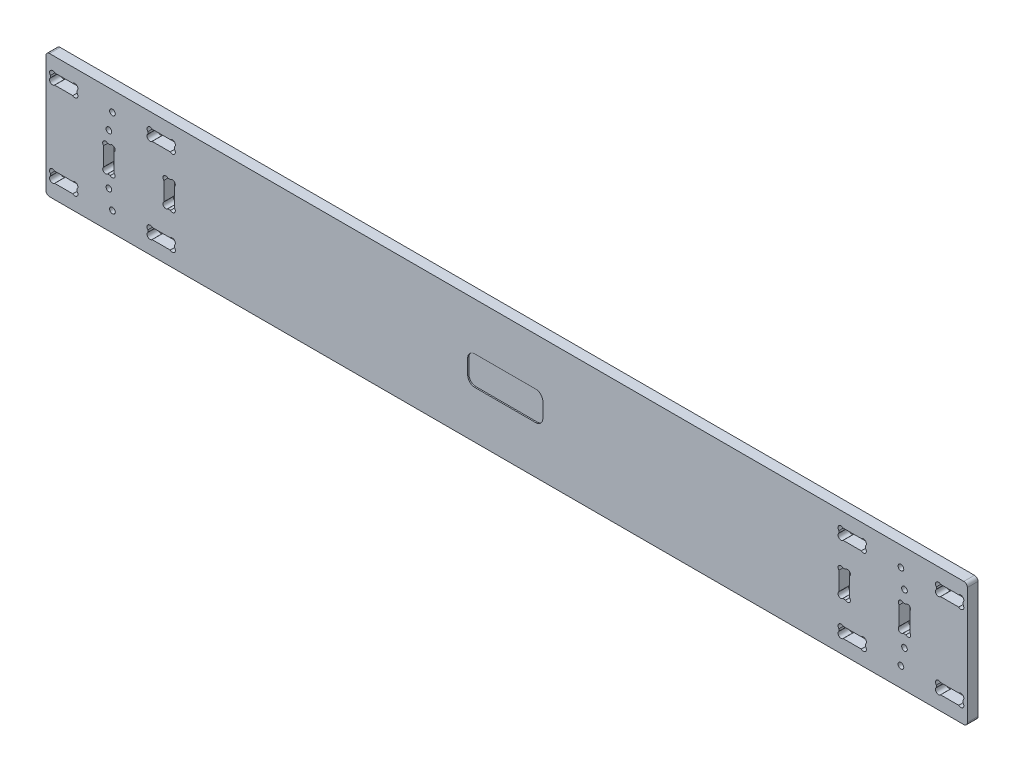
from build123d import *

# Parameters (mm, degrees)
ESQUISSE1_R             = 1.6
EXTRUSION1_DEPTH        = 6
ENL_V_MAT_EXTRU_1_DEPTH = 0.7


with BuildPart() as part:
    # Esquisse1 → Extrusion1 (new body)
    with BuildSketch(Plane.XY):
        with BuildLine():
            Line((-460.5, -102.0000018), (55.5, -102.0000018))
            ThreePointArc((55.5, -102.0000018), (56.914213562, -102.585788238), (57.5, -104.0000018))
            Line((57.5, -104.0000018), (57.5, -170.0000018))
            ThreePointArc((57.5, -170.0000018), (56.914213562, -171.414215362), (55.5, -172.0000018))
            Line((55.5, -172.0000018), (-460.5, -172.0000018))
            ThreePointArc((-460.5, -172.0000018), (-461.914213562, -171.414215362), (-462.5, -170.0000018))
            Line((-462.5, -170.0000018), (-462.5, -104.0000018))
            ThreePointArc((-462.5, -104.0000018), (-461.914213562, -102.585788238), (-460.5, -102.0000018))
        make_face()
        with Locations((20, -113.0000018)):
            Circle(ESQUISSE1_R, mode=Mode.SUBTRACT)
        with Locations((22, -122.7500018)):
            Circle(ESQUISSE1_R, mode=Mode.SUBTRACT)
        with Locations(Location((22, -151.2500018, 0), (0, 0, 180))):
            Circle(ESQUISSE1_R, mode=Mode.SUBTRACT)
        with Locations(Location((20, -161.0000018, 0), (0, 0, 180))):
            Circle(ESQUISSE1_R, mode=Mode.SUBTRACT)
        with Locations((-425, -161.0000018)):
            Circle(ESQUISSE1_R, mode=Mode.SUBTRACT)
        with Locations((-427, -151.2500018)):
            Circle(ESQUISSE1_R, mode=Mode.SUBTRACT)
        with Locations(Location((-427, -122.7500018, 0), (0, 0, 180))):
            Circle(ESQUISSE1_R, mode=Mode.SUBTRACT)
        with Locations(Location((-425, -113.0000018, 0), (0, 0, 180))):
            Circle(ESQUISSE1_R, mode=Mode.SUBTRACT)
        with BuildLine():
            Line((-11.261895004, -129.5000018), (-12.738104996, -129.5000018))
            ThreePointArc((-12.738104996, -129.5000018), (-15.03137085, -129.46863095), (-15, -131.761896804))
            Line((-15, -131.761896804), (-15, -142.238106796))
            ThreePointArc((-15, -142.238106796), (-15.03137085, -144.53137265), (-12.738104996, -144.5000018))
            Line((-12.738104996, -144.5000018), (-11.261895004, -144.5000018))
            ThreePointArc((-11.261895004, -144.5000018), (-8.96862915, -144.53137265), (-9, -142.238106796))
            Line((-9, -142.238106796), (-9, -131.761896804))
            ThreePointArc((-9, -131.761896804), (-8.96862915, -129.46863095), (-11.261895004, -129.5000018))
        make_face(mode=Mode.SUBTRACT)
        with BuildLine():
            Line((-396, -131.761896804), (-396, -142.238106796))
            ThreePointArc((-396, -142.238106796), (-396.03137085, -144.53137265), (-393.738104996, -144.5000018))
            Line((-393.738104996, -144.5000018), (-392.261895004, -144.5000018))
            ThreePointArc((-392.261895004, -144.5000018), (-389.96862915, -144.53137265), (-390, -142.238106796))
            Line((-390, -142.238106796), (-390, -131.761896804))
            ThreePointArc((-390, -131.761896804), (-389.96862915, -129.46863095), (-392.261895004, -129.5000018))
            Line((-392.261895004, -129.5000018), (-393.738104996, -129.5000018))
            ThreePointArc((-393.738104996, -129.5000018), (-396.03137085, -129.46863095), (-396, -131.761896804))
        make_face(mode=Mode.SUBTRACT)
        with BuildLine():
            Line((-12.597918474, -110), (-2.402081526, -110))
            ThreePointArc((-2.402081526, -110), (0.003120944, -110.001040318), (0, -112.406240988))
            Line((0, -112.406240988), (0, -113.593759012))
            ThreePointArc((0, -113.593759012), (0.003121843, -115.998958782), (-2.402079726, -116.0000018))
            Line((-2.402079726, -116.0000018), (-12.597920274, -116.0000018))
            ThreePointArc((-12.597920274, -116.0000018), (-15.003121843, -115.998958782), (-15, -113.593759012))
            Line((-15, -113.593759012), (-15, -112.406240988))
            ThreePointArc((-15, -112.406240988), (-15.003120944, -110.001040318), (-12.597918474, -110))
        make_face(mode=Mode.SUBTRACT)
        with BuildLine():
            Line((40, -112.406240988), (40, -113.593759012))
            ThreePointArc((40, -113.593759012), (39.996878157, -115.998958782), (42.402079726, -116.0000018))
            Line((42.402079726, -116.0000018), (52.597920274, -116.0000018))
            ThreePointArc((52.597920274, -116.0000018), (55.003121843, -115.998958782), (55, -113.593759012))
            Line((55, -113.593759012), (55, -112.406240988))
            ThreePointArc((55, -112.406240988), (55.003120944, -110.001040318), (52.597918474, -110))
            Line((52.597918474, -110), (42.402081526, -110))
            ThreePointArc((42.402081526, -110), (39.996879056, -110.001040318), (40, -112.406240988))
        make_face(mode=Mode.SUBTRACT)
        with BuildLine():
            Line((52.597918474, -164.0000036), (42.402081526, -164.0000036))
            ThreePointArc((42.402081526, -164.0000036), (39.996879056, -163.998963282), (40, -161.593762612))
            Line((40, -161.593762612), (40, -160.406244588))
            ThreePointArc((40, -160.406244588), (39.996878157, -158.001044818), (42.402079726, -158.0000018))
            Line((42.402079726, -158.0000018), (52.597920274, -158.0000018))
            ThreePointArc((52.597920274, -158.0000018), (55.003121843, -158.001044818), (55, -160.406244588))
            Line((55, -160.406244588), (55, -161.593762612))
            ThreePointArc((55, -161.593762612), (55.003120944, -163.998963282), (52.597918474, -164.0000036))
        make_face(mode=Mode.SUBTRACT)
        with BuildLine():
            Line((0, -161.593762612), (0, -160.406244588))
            ThreePointArc((0, -160.406244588), (0.003121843, -158.001044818), (-2.402079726, -158.0000018))
            Line((-2.402079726, -158.0000018), (-12.597920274, -158.0000018))
            ThreePointArc((-12.597920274, -158.0000018), (-15.003121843, -158.001044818), (-15, -160.406244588))
            Line((-15, -160.406244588), (-15, -161.593762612))
            ThreePointArc((-15, -161.593762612), (-15.003120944, -163.998963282), (-12.597918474, -164.0000036))
            Line((-12.597918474, -164.0000036), (-2.402081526, -164.0000036))
            ThreePointArc((-2.402081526, -164.0000036), (0.003120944, -163.998963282), (0, -161.593762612))
        make_face(mode=Mode.SUBTRACT)
        with BuildLine():
            Line((-445, -161.593762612), (-445, -160.406244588))
            ThreePointArc((-445, -160.406244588), (-444.996878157, -158.001044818), (-447.402079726, -158.0000018))
            Line((-447.402079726, -158.0000018), (-457.597920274, -158.0000018))
            ThreePointArc((-457.597920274, -158.0000018), (-460.003121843, -158.001044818), (-460, -160.406244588))
            Line((-460, -160.406244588), (-460, -161.593762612))
            ThreePointArc((-460, -161.593762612), (-460.003120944, -163.998963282), (-457.597918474, -164.0000036))
            Line((-457.597918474, -164.0000036), (-447.402081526, -164.0000036))
            ThreePointArc((-447.402081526, -164.0000036), (-444.996879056, -163.998963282), (-445, -161.593762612))
        make_face(mode=Mode.SUBTRACT)
        with BuildLine():
            Line((-392.402081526, -164.0000036), (-402.597918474, -164.0000036))
            ThreePointArc((-402.597918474, -164.0000036), (-405.003120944, -163.998963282), (-405, -161.593762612))
            Line((-405, -161.593762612), (-405, -160.406244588))
            ThreePointArc((-405, -160.406244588), (-405.003121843, -158.001044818), (-402.597920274, -158.0000018))
            Line((-402.597920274, -158.0000018), (-392.402079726, -158.0000018))
            ThreePointArc((-392.402079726, -158.0000018), (-389.996878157, -158.001044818), (-390, -160.406244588))
            Line((-390, -160.406244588), (-390, -161.593762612))
            ThreePointArc((-390, -161.593762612), (-389.996879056, -163.998963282), (-392.402081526, -164.0000036))
        make_face(mode=Mode.SUBTRACT)
        with BuildLine():
            Line((-405, -112.406240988), (-405, -113.593759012))
            ThreePointArc((-405, -113.593759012), (-405.003121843, -115.998958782), (-402.597920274, -116.0000018))
            Line((-402.597920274, -116.0000018), (-392.402079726, -116.0000018))
            ThreePointArc((-392.402079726, -116.0000018), (-389.996878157, -115.998958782), (-390, -113.593759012))
            Line((-390, -113.593759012), (-390, -112.406240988))
            ThreePointArc((-390, -112.406240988), (-389.996879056, -110.001040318), (-392.402081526, -110))
            Line((-392.402081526, -110), (-402.597918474, -110))
            ThreePointArc((-402.597918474, -110), (-405.003120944, -110.001040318), (-405, -112.406240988))
        make_face(mode=Mode.SUBTRACT)
        with BuildLine():
            Line((-457.597918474, -110), (-447.402081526, -110))
            ThreePointArc((-447.402081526, -110), (-444.996879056, -110.001040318), (-445, -112.406240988))
            Line((-445, -112.406240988), (-445, -113.593759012))
            ThreePointArc((-445, -113.593759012), (-444.996878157, -115.998958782), (-447.402079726, -116.0000018))
            Line((-447.402079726, -116.0000018), (-457.597920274, -116.0000018))
            ThreePointArc((-457.597920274, -116.0000018), (-460.003121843, -115.998958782), (-460, -113.593759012))
            Line((-460, -113.593759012), (-460, -112.406240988))
            ThreePointArc((-460, -112.406240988), (-460.003120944, -110.001040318), (-457.597918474, -110))
        make_face(mode=Mode.SUBTRACT)
        with BuildLine():
            Line((25, -131.761896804), (25, -142.238106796))
            ThreePointArc((25, -142.238106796), (25.03137085, -144.53137265), (22.738104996, -144.5000018))
            Line((22.738104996, -144.5000018), (21.261895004, -144.5000018))
            ThreePointArc((21.261895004, -144.5000018), (18.96862915, -144.53137265), (19, -142.238106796))
            Line((19, -142.238106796), (19, -131.761896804))
            ThreePointArc((19, -131.761896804), (18.96862915, -129.46863095), (21.261895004, -129.5000018))
            Line((21.261895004, -129.5000018), (22.738104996, -129.5000018))
            ThreePointArc((22.738104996, -129.5000018), (25.03137085, -129.46863095), (25, -131.761896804))
        make_face(mode=Mode.SUBTRACT)
        with BuildLine():
            Line((-430, -131.761896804), (-430, -142.238106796))
            ThreePointArc((-430, -142.238106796), (-430.03137085, -144.53137265), (-427.738104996, -144.5000018))
            Line((-427.738104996, -144.5000018), (-426.261895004, -144.5000018))
            ThreePointArc((-426.261895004, -144.5000018), (-423.96862915, -144.53137265), (-424, -142.238106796))
            Line((-424, -142.238106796), (-424, -131.761896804))
            ThreePointArc((-424, -131.761896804), (-423.96862915, -129.46863095), (-426.261895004, -129.5000018))
            Line((-426.261895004, -129.5000018), (-427.738104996, -129.5000018))
            ThreePointArc((-427.738104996, -129.5000018), (-430.03137085, -129.46863095), (-430, -131.761896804))
        make_face(mode=Mode.SUBTRACT)
    extrude(amount=EXTRUSION1_DEPTH)

    # Esquisse2 → Enl_v. mat.-Extru.1 (cut)
    with BuildSketch(Plane.XY.offset(6)):
        with BuildLine():
            Line((-220.5, -128.8000018), (-186.1, -128.8000018))
            ThreePointArc((-186.1, -128.8000018), (-183.271572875, -129.971574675), (-182.1, -132.8000018))
            Line((-182.1, -132.8000018), (-182.1, -141.2000018))
            ThreePointArc((-182.1, -141.2000018), (-183.271572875, -144.028428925), (-186.1, -145.2000018))
            Line((-186.1, -145.2000018), (-220.5, -145.2000018))
            ThreePointArc((-220.5, -145.2000018), (-223.328427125, -144.028428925), (-224.5, -141.2000018))
            Line((-224.5, -141.2000018), (-224.5, -132.8000018))
            ThreePointArc((-224.5, -132.8000018), (-223.328427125, -129.971574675), (-220.5, -128.8000018))
        make_face()
    extrude(amount=-ENL_V_MAT_EXTRU_1_DEPTH, mode=Mode.SUBTRACT)


solid = part.part
